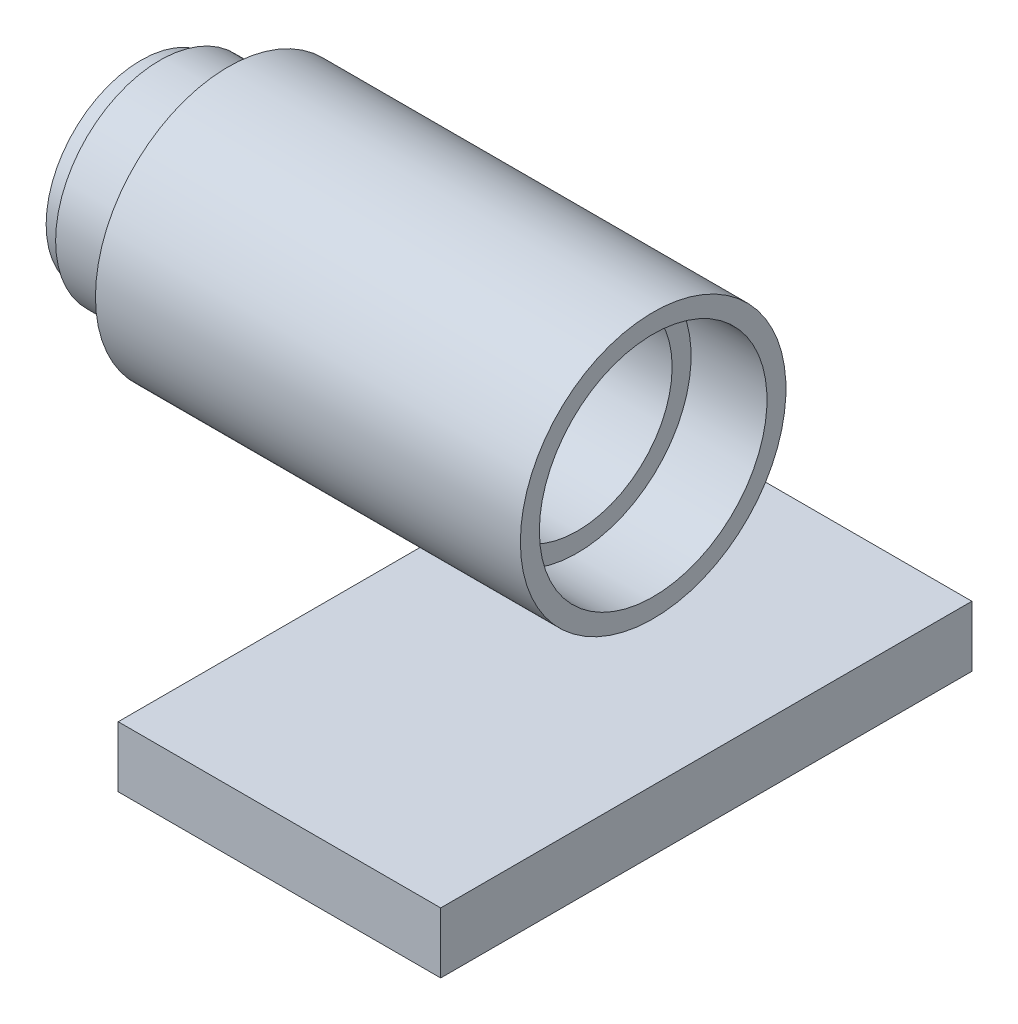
ISO-10303-21;
HEADER;
FILE_DESCRIPTION(('STEP AP214'),'2;1');
FILE_NAME('part.step','',(''),(''),'','','');
FILE_SCHEMA(('AUTOMOTIVE_DESIGN { 1 0 10303 214 1 1 1 1 }'));
ENDSEC;
DATA;
#1=APPLICATION_CONTEXT('core data for automotive mechanical design processes');
#2=APPLICATION_PROTOCOL_DEFINITION('international standard','automotive_design',2000,#1);
#3=PRODUCT_CONTEXT('',#1,'mechanical');
#4=PRODUCT('Part','Part','',(#3));
#5=PRODUCT_RELATED_PRODUCT_CATEGORY('part','',(#4));
#6=PRODUCT_DEFINITION_FORMATION('','',#4);
#7=PRODUCT_DEFINITION_CONTEXT('part definition',#1,'design');
#8=PRODUCT_DEFINITION('design','',#6,#7);
#9=PRODUCT_DEFINITION_SHAPE('','',#8);
#10=(LENGTH_UNIT() NAMED_UNIT(*) SI_UNIT(.MILLI.,.METRE.));
#11=(NAMED_UNIT(*) PLANE_ANGLE_UNIT() SI_UNIT($,.RADIAN.));
#12=(NAMED_UNIT(*) SI_UNIT($,.STERADIAN.) SOLID_ANGLE_UNIT());
#13=UNCERTAINTY_MEASURE_WITH_UNIT(LENGTH_MEASURE(1.E-05),#10,'distance_accuracy_value','');
#14=(GEOMETRIC_REPRESENTATION_CONTEXT(3) GLOBAL_UNCERTAINTY_ASSIGNED_CONTEXT((#13)) GLOBAL_UNIT_ASSIGNED_CONTEXT((#10,
#11,#12)) REPRESENTATION_CONTEXT('',''));
#15=CARTESIAN_POINT('',(0.,0.,0.));
#16=DIRECTION('',(0.,0.,1.));
#17=DIRECTION('',(1.,0.,0.));
#18=AXIS2_PLACEMENT_3D('',#15,#16,#17);
#19=CARTESIAN_POINT('',(-34.,100.,0.));
#20=DIRECTION('',(-1.,0.,0.));
#21=DIRECTION('',(0.,0.,1.));
#22=AXIS2_PLACEMENT_3D('',#19,#20,#21);
#23=PLANE('',#22);
#24=CARTESIAN_POINT('',(-34.,75.,0.));
#25=DIRECTION('',(-1.,0.,0.));
#26=DIRECTION('',(0.,0.,1.));
#27=AXIS2_PLACEMENT_3D('',#24,#25,#26);
#28=CIRCLE('',#27,30.);
#29=CARTESIAN_POINT('',(-34.,75.,30.));
#30=VERTEX_POINT('',#29);
#31=EDGE_CURVE('E81',#30,#30,#28,.T.);
#32=ORIENTED_EDGE('',*,*,#31,.F.);
#33=EDGE_LOOP('',(#32));
#34=FACE_BOUND('',#33,.T.);
#35=CARTESIAN_POINT('',(-34.,75.,0.));
#36=DIRECTION('',(-1.,0.,0.));
#37=DIRECTION('',(0.,0.,1.));
#38=AXIS2_PLACEMENT_3D('',#35,#36,#37);
#39=CIRCLE('',#38,25.);
#40=CARTESIAN_POINT('',(-34.,75.,25.));
#41=VERTEX_POINT('',#40);
#42=EDGE_CURVE('E11',#41,#41,#39,.T.);
#43=ORIENTED_EDGE('',*,*,#42,.T.);
#44=EDGE_LOOP('',(#43));
#45=FACE_BOUND('',#44,.T.);
#46=ADVANCED_FACE('F41',(#34,#45),#23,.F.);
#47=CARTESIAN_POINT('',(-107.067924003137,75.,0.));
#48=DIRECTION('',(-1.,0.,0.));
#49=DIRECTION('',(0.,0.,1.));
#50=AXIS2_PLACEMENT_3D('',#47,#48,#49);
#51=CYLINDRICAL_SURFACE('',#50,25.);
#52=ORIENTED_EDGE('',*,*,#42,.F.);
#53=EDGE_LOOP('',(#52));
#54=FACE_BOUND('',#53,.T.);
#55=CARTESIAN_POINT('',(-114.,75.,0.));
#56=DIRECTION('',(-1.,0.,0.));
#57=DIRECTION('',(0.,0.,1.));
#58=AXIS2_PLACEMENT_3D('',#55,#56,#57);
#59=CIRCLE('',#58,25.);
#60=CARTESIAN_POINT('',(-114.,75.,25.));
#61=VERTEX_POINT('',#60);
#62=EDGE_CURVE('E47',#61,#61,#59,.T.);
#63=ORIENTED_EDGE('',*,*,#62,.T.);
#64=EDGE_LOOP('',(#63));
#65=FACE_BOUND('',#64,.T.);
#66=ADVANCED_FACE('F88',(#54,#65),#51,.F.);
#67=CARTESIAN_POINT('',(-114.,100.,0.));
#68=DIRECTION('',(-1.,0.,0.));
#69=DIRECTION('',(0.,0.,1.));
#70=AXIS2_PLACEMENT_3D('',#67,#68,#69);
#71=PLANE('',#70);
#72=ORIENTED_EDGE('',*,*,#62,.F.);
#73=EDGE_LOOP('',(#72));
#74=FACE_BOUND('',#73,.T.);
#75=CARTESIAN_POINT('',(-114.,75.,0.));
#76=DIRECTION('',(-1.,0.,0.));
#77=DIRECTION('',(0.,0.,1.));
#78=AXIS2_PLACEMENT_3D('',#75,#76,#77);
#79=CIRCLE('',#78,16.);
#80=CARTESIAN_POINT('',(-114.,75.,16.));
#81=VERTEX_POINT('',#80);
#82=EDGE_CURVE('E51',#81,#81,#79,.T.);
#83=ORIENTED_EDGE('',*,*,#82,.T.);
#84=EDGE_LOOP('',(#83));
#85=FACE_BOUND('',#84,.T.);
#86=ADVANCED_FACE('F92',(#74,#85),#71,.F.);
#87=CARTESIAN_POINT('',(-107.067924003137,75.,0.));
#88=DIRECTION('',(-1.,0.,0.));
#89=DIRECTION('',(0.,0.,1.));
#90=AXIS2_PLACEMENT_3D('',#87,#88,#89);
#91=CYLINDRICAL_SURFACE('',#90,16.);
#92=ORIENTED_EDGE('',*,*,#82,.F.);
#93=EDGE_LOOP('',(#92));
#94=FACE_BOUND('',#93,.T.);
#95=CARTESIAN_POINT('',(-149.,75.,0.));
#96=DIRECTION('',(-1.,0.,0.));
#97=DIRECTION('',(0.,0.,1.));
#98=AXIS2_PLACEMENT_3D('',#95,#96,#97);
#99=CIRCLE('',#98,16.);
#100=CARTESIAN_POINT('',(-149.,75.,16.));
#101=VERTEX_POINT('',#100);
#102=EDGE_CURVE('E55',#101,#101,#99,.T.);
#103=ORIENTED_EDGE('',*,*,#102,.T.);
#104=EDGE_LOOP('',(#103));
#105=FACE_BOUND('',#104,.T.);
#106=ADVANCED_FACE('F97',(#94,#105),#91,.F.);
#107=CARTESIAN_POINT('',(-149.,91.,0.));
#108=DIRECTION('',(1.,0.,0.));
#109=DIRECTION('',(0.,0.,-1.));
#110=AXIS2_PLACEMENT_3D('',#107,#108,#109);
#111=PLANE('',#110);
#112=ORIENTED_EDGE('',*,*,#102,.F.);
#113=EDGE_LOOP('',(#112));
#114=FACE_BOUND('',#113,.T.);
#115=CARTESIAN_POINT('',(-149.,75.,0.));
#116=DIRECTION('',(-1.,0.,0.));
#117=DIRECTION('',(0.,0.,1.));
#118=AXIS2_PLACEMENT_3D('',#115,#116,#117);
#119=CIRCLE('',#118,25.);
#120=CARTESIAN_POINT('',(-149.,75.,25.));
#121=VERTEX_POINT('',#120);
#122=EDGE_CURVE('E60',#121,#121,#119,.T.);
#123=ORIENTED_EDGE('',*,*,#122,.T.);
#124=EDGE_LOOP('',(#123));
#125=FACE_BOUND('',#124,.T.);
#126=ADVANCED_FACE('F103',(#114,#125),#111,.F.);
#127=CARTESIAN_POINT('',(-107.067924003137,75.,0.));
#128=DIRECTION('',(-1.,0.,0.));
#129=DIRECTION('',(0.,0.,1.));
#130=AXIS2_PLACEMENT_3D('',#127,#128,#129);
#131=CYLINDRICAL_SURFACE('',#130,25.);
#132=ORIENTED_EDGE('',*,*,#122,.F.);
#133=EDGE_LOOP('',(#132));
#134=FACE_BOUND('',#133,.T.);
#135=CARTESIAN_POINT('',(-144.,75.,0.));
#136=DIRECTION('',(-1.,0.,0.));
#137=DIRECTION('',(0.,0.,1.));
#138=AXIS2_PLACEMENT_3D('',#135,#136,#137);
#139=CIRCLE('',#138,25.);
#140=CARTESIAN_POINT('',(-144.,75.,25.));
#141=VERTEX_POINT('',#140);
#142=EDGE_CURVE('E63',#141,#141,#139,.T.);
#143=ORIENTED_EDGE('',*,*,#142,.T.);
#144=EDGE_LOOP('',(#143));
#145=FACE_BOUND('',#144,.T.);
#146=ADVANCED_FACE('F107',(#134,#145),#131,.T.);
#147=CARTESIAN_POINT('',(-144.,100.,0.));
#148=DIRECTION('',(1.,0.,0.));
#149=DIRECTION('',(0.,0.,-1.));
#150=AXIS2_PLACEMENT_3D('',#147,#148,#149);
#151=PLANE('',#150);
#152=ORIENTED_EDGE('',*,*,#142,.F.);
#153=EDGE_LOOP('',(#152));
#154=FACE_BOUND('',#153,.T.);
#155=CARTESIAN_POINT('',(-144.,75.,0.));
#156=DIRECTION('',(-1.,0.,0.));
#157=DIRECTION('',(0.,0.,1.));
#158=AXIS2_PLACEMENT_3D('',#155,#156,#157);
#159=CIRCLE('',#158,27.5);
#160=CARTESIAN_POINT('',(-144.,75.,27.5));
#161=VERTEX_POINT('',#160);
#162=EDGE_CURVE('E66',#161,#161,#159,.T.);
#163=ORIENTED_EDGE('',*,*,#162,.T.);
#164=EDGE_LOOP('',(#163));
#165=FACE_BOUND('',#164,.T.);
#166=ADVANCED_FACE('F111',(#154,#165),#151,.F.);
#167=CARTESIAN_POINT('',(-107.067924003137,75.,0.));
#168=DIRECTION('',(-1.,0.,0.));
#169=DIRECTION('',(0.,0.,1.));
#170=AXIS2_PLACEMENT_3D('',#167,#168,#169);
#171=CYLINDRICAL_SURFACE('',#170,27.5);
#172=ORIENTED_EDGE('',*,*,#162,.F.);
#173=EDGE_LOOP('',(#172));
#174=FACE_BOUND('',#173,.T.);
#175=CARTESIAN_POINT('',(-126.,75.,0.));
#176=DIRECTION('',(-1.,0.,0.));
#177=DIRECTION('',(0.,0.,1.));
#178=AXIS2_PLACEMENT_3D('',#175,#176,#177);
#179=CIRCLE('',#178,27.5);
#180=CARTESIAN_POINT('',(-126.,75.,27.5));
#181=VERTEX_POINT('',#180);
#182=EDGE_CURVE('E69',#181,#181,#179,.T.);
#183=ORIENTED_EDGE('',*,*,#182,.T.);
#184=EDGE_LOOP('',(#183));
#185=FACE_BOUND('',#184,.T.);
#186=ADVANCED_FACE('F115',(#174,#185),#171,.T.);
#187=CARTESIAN_POINT('',(-126.,102.5,0.));
#188=DIRECTION('',(1.,0.,0.));
#189=DIRECTION('',(0.,0.,-1.));
#190=AXIS2_PLACEMENT_3D('',#187,#188,#189);
#191=PLANE('',#190);
#192=ORIENTED_EDGE('',*,*,#182,.F.);
#193=EDGE_LOOP('',(#192));
#194=FACE_BOUND('',#193,.T.);
#195=CARTESIAN_POINT('',(-126.,75.,0.));
#196=DIRECTION('',(-1.,0.,0.));
#197=DIRECTION('',(0.,0.,1.));
#198=AXIS2_PLACEMENT_3D('',#195,#196,#197);
#199=CIRCLE('',#198,35.);
#200=CARTESIAN_POINT('',(-126.,75.,35.));
#201=VERTEX_POINT('',#200);
#202=EDGE_CURVE('E72',#201,#201,#199,.T.);
#203=ORIENTED_EDGE('',*,*,#202,.T.);
#204=EDGE_LOOP('',(#203));
#205=FACE_BOUND('',#204,.T.);
#206=ADVANCED_FACE('F119',(#194,#205),#191,.F.);
#207=CARTESIAN_POINT('',(-107.067924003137,75.,0.));
#208=DIRECTION('',(-1.,0.,0.));
#209=DIRECTION('',(0.,0.,1.));
#210=AXIS2_PLACEMENT_3D('',#207,#208,#209);
#211=CYLINDRICAL_SURFACE('',#210,35.);
#212=ORIENTED_EDGE('',*,*,#202,.F.);
#213=EDGE_LOOP('',(#212));
#214=FACE_BOUND('',#213,.T.);
#215=CARTESIAN_POINT('',(-14.,75.,0.));
#216=DIRECTION('',(-1.,0.,0.));
#217=DIRECTION('',(0.,0.,1.));
#218=AXIS2_PLACEMENT_3D('',#215,#216,#217);
#219=CIRCLE('',#218,35.);
#220=CARTESIAN_POINT('',(-14.,75.,35.));
#221=VERTEX_POINT('',#220);
#222=EDGE_CURVE('E75',#221,#221,#219,.T.);
#223=ORIENTED_EDGE('',*,*,#222,.T.);
#224=EDGE_LOOP('',(#223));
#225=FACE_BOUND('',#224,.T.);
#226=ADVANCED_FACE('F123',(#214,#225),#211,.T.);
#227=CARTESIAN_POINT('',(-14.,110.,0.));
#228=DIRECTION('',(-1.,0.,0.));
#229=DIRECTION('',(0.,0.,1.));
#230=AXIS2_PLACEMENT_3D('',#227,#228,#229);
#231=PLANE('',#230);
#232=ORIENTED_EDGE('',*,*,#222,.F.);
#233=EDGE_LOOP('',(#232));
#234=FACE_BOUND('',#233,.T.);
#235=CARTESIAN_POINT('',(-14.,75.,0.));
#236=DIRECTION('',(-1.,0.,0.));
#237=DIRECTION('',(0.,0.,1.));
#238=AXIS2_PLACEMENT_3D('',#235,#236,#237);
#239=CIRCLE('',#238,30.);
#240=CARTESIAN_POINT('',(-14.,75.,30.));
#241=VERTEX_POINT('',#240);
#242=EDGE_CURVE('E78',#241,#241,#239,.T.);
#243=ORIENTED_EDGE('',*,*,#242,.T.);
#244=EDGE_LOOP('',(#243));
#245=FACE_BOUND('',#244,.T.);
#246=ADVANCED_FACE('F127',(#234,#245),#231,.F.);
#247=CARTESIAN_POINT('',(-107.067924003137,75.,0.));
#248=DIRECTION('',(-1.,0.,0.));
#249=DIRECTION('',(0.,0.,1.));
#250=AXIS2_PLACEMENT_3D('',#247,#248,#249);
#251=CYLINDRICAL_SURFACE('',#250,30.);
#252=ORIENTED_EDGE('',*,*,#242,.F.);
#253=EDGE_LOOP('',(#252));
#254=FACE_BOUND('',#253,.T.);
#255=ORIENTED_EDGE('',*,*,#31,.T.);
#256=EDGE_LOOP('',(#255));
#257=FACE_BOUND('',#256,.T.);
#258=ADVANCED_FACE('F85',(#254,#257),#251,.F.);
#259=CLOSED_SHELL('',(#46,#66,#86,#106,#126,#146,#166,#186,#206,#226,#246,#258));
#260=MANIFOLD_SOLID_BREP('B2',#259);
#261=CARTESIAN_POINT('',(-85.,0.,70.));
#262=DIRECTION('',(0.,1.,0.));
#263=DIRECTION('',(-1.,0.,0.));
#264=AXIS2_PLACEMENT_3D('',#261,#262,#263);
#265=PLANE('',#264);
#266=DIRECTION('',(1.,0.,0.));
#267=VECTOR('',#266,1.);
#268=CARTESIAN_POINT('',(-85.,0.,-70.));
#269=LINE('',#268,#267);
#270=CARTESIAN_POINT('',(-85.,0.,-70.));
#271=VERTEX_POINT('',#270);
#272=CARTESIAN_POINT('',(0.,0.,-70.));
#273=VERTEX_POINT('',#272);
#274=EDGE_CURVE('E286',#271,#273,#269,.T.);
#275=ORIENTED_EDGE('',*,*,#274,.T.);
#276=DIRECTION('',(0.,0.,-1.));
#277=VECTOR('',#276,1.);
#278=CARTESIAN_POINT('',(0.,0.,70.));
#279=LINE('',#278,#277);
#280=CARTESIAN_POINT('',(0.,0.,70.));
#281=VERTEX_POINT('',#280);
#282=EDGE_CURVE('E39',#281,#273,#279,.T.);
#283=ORIENTED_EDGE('',*,*,#282,.F.);
#284=DIRECTION('',(1.,0.,0.));
#285=VECTOR('',#284,1.);
#286=CARTESIAN_POINT('',(-85.,0.,70.));
#287=LINE('',#286,#285);
#288=CARTESIAN_POINT('',(-85.,0.,70.));
#289=VERTEX_POINT('',#288);
#290=EDGE_CURVE('E274',#289,#281,#287,.T.);
#291=ORIENTED_EDGE('',*,*,#290,.F.);
#292=DIRECTION('',(0.,0.,-1.));
#293=VECTOR('',#292,1.);
#294=CARTESIAN_POINT('',(-85.,0.,70.));
#295=LINE('',#294,#293);
#296=EDGE_CURVE('E282',#289,#271,#295,.T.);
#297=ORIENTED_EDGE('',*,*,#296,.T.);
#298=EDGE_LOOP('',(#275,#283,#291,#297));
#299=FACE_BOUND('',#298,.T.);
#300=ADVANCED_FACE('F223',(#299),#265,.F.);
#301=CARTESIAN_POINT('',(0.,0.,70.));
#302=DIRECTION('',(-1.,0.,0.));
#303=DIRECTION('',(0.,-1.,0.));
#304=AXIS2_PLACEMENT_3D('',#301,#302,#303);
#305=PLANE('',#304);
#306=DIRECTION('',(0.,1.,0.));
#307=VECTOR('',#306,1.);
#308=CARTESIAN_POINT('',(0.,0.,-70.));
#309=LINE('',#308,#307);
#310=CARTESIAN_POINT('',(0.,16.,-70.));
#311=VERTEX_POINT('',#310);
#312=EDGE_CURVE('E278',#273,#311,#309,.T.);
#313=ORIENTED_EDGE('',*,*,#312,.T.);
#314=DIRECTION('',(0.,0.,-1.));
#315=VECTOR('',#314,1.);
#316=CARTESIAN_POINT('',(0.,16.,70.));
#317=LINE('',#316,#315);
#318=CARTESIAN_POINT('',(0.,16.,70.));
#319=VERTEX_POINT('',#318);
#320=EDGE_CURVE('E231',#319,#311,#317,.T.);
#321=ORIENTED_EDGE('',*,*,#320,.F.);
#322=DIRECTION('',(0.,1.,0.));
#323=VECTOR('',#322,1.);
#324=CARTESIAN_POINT('',(0.,0.,70.));
#325=LINE('',#324,#323);
#326=EDGE_CURVE('E269',#281,#319,#325,.T.);
#327=ORIENTED_EDGE('',*,*,#326,.F.);
#328=ORIENTED_EDGE('',*,*,#282,.T.);
#329=EDGE_LOOP('',(#313,#321,#327,#328));
#330=FACE_BOUND('',#329,.T.);
#331=ADVANCED_FACE('F277',(#330),#305,.F.);
#332=CARTESIAN_POINT('',(0.,16.,70.));
#333=DIRECTION('',(0.,-1.,0.));
#334=DIRECTION('',(1.,0.,0.));
#335=AXIS2_PLACEMENT_3D('',#332,#333,#334);
#336=PLANE('',#335);
#337=DIRECTION('',(-1.,0.,0.));
#338=VECTOR('',#337,1.);
#339=CARTESIAN_POINT('',(0.,16.,-70.));
#340=LINE('',#339,#338);
#341=CARTESIAN_POINT('',(-85.,16.,-70.));
#342=VERTEX_POINT('',#341);
#343=EDGE_CURVE('E256',#311,#342,#340,.T.);
#344=ORIENTED_EDGE('',*,*,#343,.T.);
#345=DIRECTION('',(0.,0.,-1.));
#346=VECTOR('',#345,1.);
#347=CARTESIAN_POINT('',(-85.,16.,70.));
#348=LINE('',#347,#346);
#349=CARTESIAN_POINT('',(-85.,16.,70.));
#350=VERTEX_POINT('',#349);
#351=EDGE_CURVE('E279',#350,#342,#348,.T.);
#352=ORIENTED_EDGE('',*,*,#351,.F.);
#353=DIRECTION('',(-1.,0.,0.));
#354=VECTOR('',#353,1.);
#355=CARTESIAN_POINT('',(0.,16.,70.));
#356=LINE('',#355,#354);
#357=EDGE_CURVE('E272',#319,#350,#356,.T.);
#358=ORIENTED_EDGE('',*,*,#357,.F.);
#359=ORIENTED_EDGE('',*,*,#320,.T.);
#360=EDGE_LOOP('',(#344,#352,#358,#359));
#361=FACE_BOUND('',#360,.T.);
#362=ADVANCED_FACE('F280',(#361),#336,.F.);
#363=CARTESIAN_POINT('',(-85.,16.,70.));
#364=DIRECTION('',(1.,0.,0.));
#365=DIRECTION('',(0.,0.,-1.));
#366=AXIS2_PLACEMENT_3D('',#363,#364,#365);
#367=PLANE('',#366);
#368=DIRECTION('',(0.,-1.,0.));
#369=VECTOR('',#368,1.);
#370=CARTESIAN_POINT('',(-85.,16.,-70.));
#371=LINE('',#370,#369);
#372=EDGE_CURVE('E262',#342,#271,#371,.T.);
#373=ORIENTED_EDGE('',*,*,#372,.T.);
#374=ORIENTED_EDGE('',*,*,#296,.F.);
#375=DIRECTION('',(0.,-1.,0.));
#376=VECTOR('',#375,1.);
#377=CARTESIAN_POINT('',(-85.,16.,70.));
#378=LINE('',#377,#376);
#379=EDGE_CURVE('E239',#350,#289,#378,.T.);
#380=ORIENTED_EDGE('',*,*,#379,.F.);
#381=ORIENTED_EDGE('',*,*,#351,.T.);
#382=EDGE_LOOP('',(#373,#374,#380,#381));
#383=FACE_BOUND('',#382,.T.);
#384=ADVANCED_FACE('F293',(#383),#367,.F.);
#385=CARTESIAN_POINT('',(0.,0.,70.));
#386=DIRECTION('',(0.,0.,1.));
#387=DIRECTION('',(1.,0.,0.));
#388=AXIS2_PLACEMENT_3D('',#385,#386,#387);
#389=PLANE('',#388);
#390=ORIENTED_EDGE('',*,*,#290,.T.);
#391=ORIENTED_EDGE('',*,*,#326,.T.);
#392=ORIENTED_EDGE('',*,*,#357,.T.);
#393=ORIENTED_EDGE('',*,*,#379,.T.);
#394=EDGE_LOOP('',(#390,#391,#392,#393));
#395=FACE_BOUND('',#394,.T.);
#396=ADVANCED_FACE('F270',(#395),#389,.T.);
#397=CARTESIAN_POINT('',(0.,0.,-70.));
#398=DIRECTION('',(0.,0.,1.));
#399=DIRECTION('',(1.,0.,0.));
#400=AXIS2_PLACEMENT_3D('',#397,#398,#399);
#401=PLANE('',#400);
#402=ORIENTED_EDGE('',*,*,#274,.F.);
#403=ORIENTED_EDGE('',*,*,#372,.F.);
#404=ORIENTED_EDGE('',*,*,#343,.F.);
#405=ORIENTED_EDGE('',*,*,#312,.F.);
#406=EDGE_LOOP('',(#402,#403,#404,#405));
#407=FACE_BOUND('',#406,.T.);
#408=ADVANCED_FACE('F296',(#407),#401,.F.);
#409=CLOSED_SHELL('',(#300,#331,#362,#384,#396,#408));
#410=MANIFOLD_SOLID_BREP('B6',#409);
#411=ADVANCED_BREP_SHAPE_REPRESENTATION('',(#18,#260,#410),#14);
#412=SHAPE_DEFINITION_REPRESENTATION(#9,#411);
ENDSEC;
END-ISO-10303-21;
